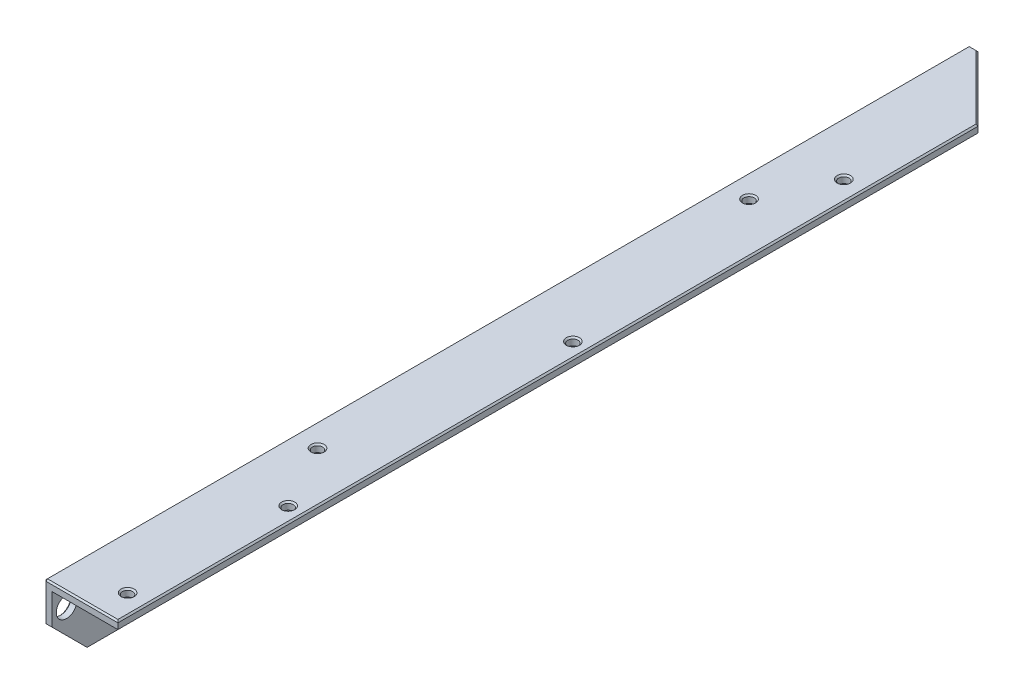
from build123d import *

# Parameters (mm, degrees)
BASE_EXTRUSION_DEPTH     = 315
ESQUISSE3_R              = 1.75
ENL_V_MAT_EXTRU_2_DEPTH  = 3
ENL_V_MAT_EXTRU_5_DEPTH  = 3
ENL_V_MAT_EXTRU_6_DEPTH  = 3
ENL_V_MAT_EXTRU_9_DEPTH  = 3
ESQUISSE8_R              = 3.5
ENL_V_MAT_EXTRU_10_DEPTH = 3
CHANFREIN1_SIZE          = 0.5


with BuildPart() as part:
    # Esquisse1 → Base-Extrusion (new body)
    with BuildSketch(Plane.XY):
        Polygon((0, 0), (0, 25), (25, 25), (25, 22.5), (2.5, 22.5), (2.5, 0), align=None)
    extrude(amount=BASE_EXTRUSION_DEPTH)

    # Esquisse3 → Enl_v. mat.-Extru.2 (cut)
    with BuildSketch(Plane(origin=(0, 25, 0), x_dir=(-1, 0, 0), z_dir=(0, 1, 0))):
        with Locations(Location((-18.3, 61, 0), (0, 0, 90))):
            Circle(ESQUISSE3_R)
        with Locations(Location((-8, 83, 0), (0, 0, 90))):
            Circle(ESQUISSE3_R)
        with Locations(Location((-20, 155, 0), (0, 0, 90))):
            Circle(ESQUISSE3_R)
        with Locations(Location((-8, 230, 0), (0, 0, 90))):
            Circle(ESQUISSE3_R)
        with Locations(Location((-20, 252, 0), (0, 0, 90))):
            Circle(ESQUISSE3_R)
        with Locations(Location((-18.3, 305, 0), (0, 0, 90))):
            Circle(ESQUISSE3_R)
    extrude(amount=-ENL_V_MAT_EXTRU_2_DEPTH, mode=Mode.SUBTRACT)

    # Esquisse5 → Enl_v. mat.-Extru.5 (cut)
    with BuildSketch(Plane(origin=(0, 25, 0), x_dir=(-1, 0, 0), z_dir=(0, 1, 0))):
        Polygon((-3, 0), (-25, 22), (-25, 0), align=None)
    extrude(amount=-ENL_V_MAT_EXTRU_5_DEPTH, mode=Mode.SUBTRACT)

    # Esquisse6 → Enl_v. mat.-Extru.6 (cut)
    with BuildSketch(Plane.ZY):
        Polygon((315, 12), (303, 0), (315, 0), align=None)
    extrude(amount=-ENL_V_MAT_EXTRU_6_DEPTH, mode=Mode.SUBTRACT)

    # Esquisse7 → Enl_v. mat.-Extru.9 (cut)
    with BuildSketch(Plane.ZY):
        with BuildLine():
            Line((255, 0), (255, 13.5))
            ThreePointArc((255, 13.5), (255.732233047, 15.267766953), (257.5, 16))
            Line((257.5, 16), (272.5, 16))
            ThreePointArc((272.5, 16), (274.267766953, 15.267766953), (275, 13.5))
            Line((275, 13.5), (275, 0))
            Line((275, 0), (255, 0))
        make_face()
    extrude(amount=-ENL_V_MAT_EXTRU_9_DEPTH, mode=Mode.SUBTRACT)

    # Esquisse8 → Enl_v. mat.-Extru.10 (cut)
    with BuildSketch(Plane.ZY):
        with Locations((310, 15.5)):
            Circle(ESQUISSE8_R)
        with Locations((5, 15.5)):
            Circle(ESQUISSE8_R)
    extrude(amount=-ENL_V_MAT_EXTRU_10_DEPTH, mode=Mode.SUBTRACT)

    # Chanfrein1
    chanfrein1_edges = [part.edges().sort_by_distance(p)[0] for p in [
        (0, 12.5, 0),
        (0, 0, 127.5),
        (0, 25, 157.5),
        (0, 6.75, 255),
        (0, 18.5, 315),
        (0, 15.267766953, 255.732233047),
        (0, 6, 309),
        (0, 16, 265),
        (0, 0, 289),
        (0, 15.267766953, 274.267766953),
        (0, 6.75, 275),
        (0, 15.5, 306.5),
        (0, 15.5, 1.5),
        (1.5, 25, 0),
        (14, 25, 11),
        (25, 25, 168.5),
        (12.5, 25, 315),
        (8, 25, 228.25),
        (18.3, 25, 303.25),
        (20, 25, 250.25),
        (8, 25, 81.25),
        (20, 25, 153.25),
        (18.3, 25, 59.25),
    ]]
    chamfer(chanfrein1_edges, length=CHANFREIN1_SIZE)


solid = part.part
